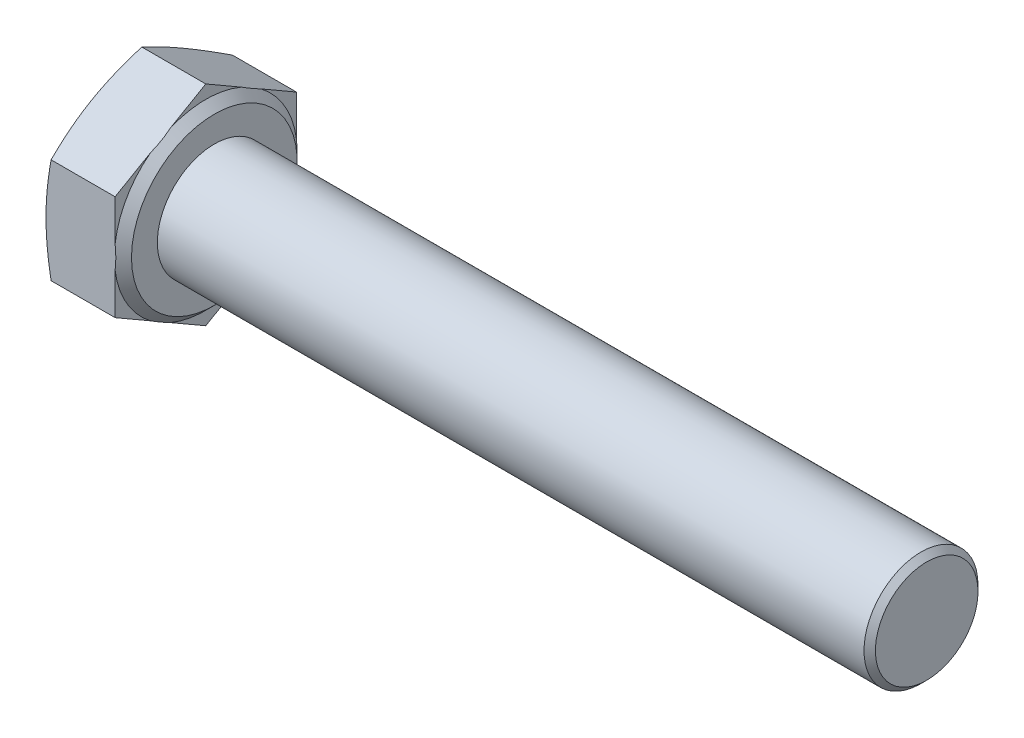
from build123d import *

# Parameters (mm, degrees)
BASEHEAD_DEPTH = 5.45
SKETCH5_R      = 4
BASEBODY_DEPTH = 50
CHAMFER1_SIZE  = 0.4


with BuildPart() as part:
    # Sketch2 → BaseHead (new body)
    with BuildSketch(Plane(origin=(0, 0, 0), x_dir=(0, 0, -1), z_dir=(1, 0, 0))):
        Polygon((6.365, -3.674834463), (6.365, 3.674834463), (0, 7.349668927), (-6.365, 3.674834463), (-6.365, -3.674834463), (0, -7.349668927), align=None)
    extrude(amount=BASEHEAD_DEPTH)

    # Sketch3 → BearingFace (revolve, cut)
    with BuildSketch(Plane.XY, mode=Mode.PRIVATE) as bearingface_sk:
        Polygon((5.45, 7.349668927), (5.45, 5.815), (4.85, 6.415), (4.85, 7.349668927), align=None)
    revolve(bearingface_sk.sketch.rotate(Axis((-0.957090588, 0, 0), (1, 0, 0)), 90), axis=Axis((-0.957090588, 0, 0), (1, 0, 0)), mode=Mode.SUBTRACT)

    # Sketch4 → HeadChamfer (revolve, cut)
    with BuildSketch(Plane.XY):
        Polygon((0, 7.349668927), (0.35839018, 7.349668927), (0, 6.365), align=None)
    revolve(axis=Axis((-0.493528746, 0, 0), (1, 0, 0)), mode=Mode.SUBTRACT)

    # Sketch5 → BaseBody (add)
    with BuildSketch(Plane(origin=(5.45, 0, 0), x_dir=(0, 0, -1), z_dir=(1, 0, 0))):
        Circle(SKETCH5_R)
    extrude(amount=BASEBODY_DEPTH)

    # Chamfer1
    chamfer1_edges = [part.edges().sort_by_distance(p)[0] for p in [
        (55.45, 0, 4),
    ]]
    chamfer(chamfer1_edges, length=CHAMFER1_SIZE)


solid = part.part
